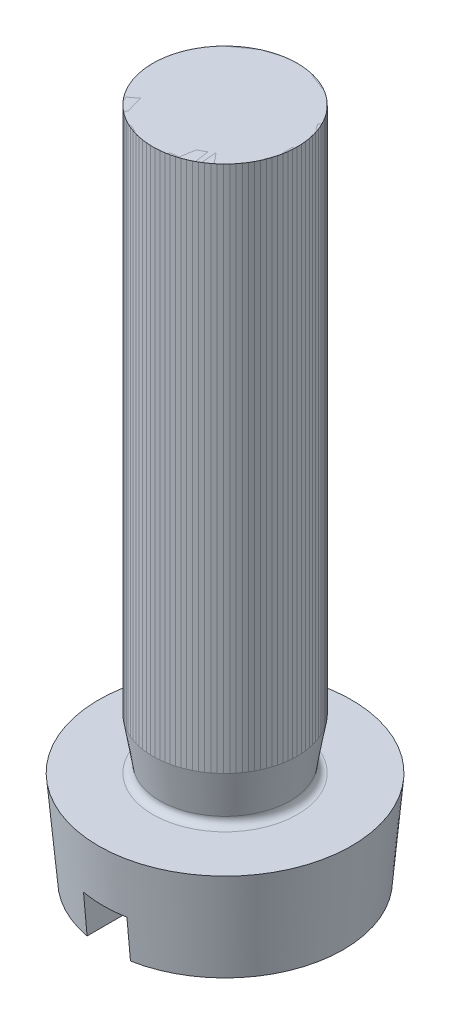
ISO-10303-21;
HEADER;
FILE_DESCRIPTION(('STEP AP214'),'2;1');
FILE_NAME('part.step','',(''),(''),'','','');
FILE_SCHEMA(('AUTOMOTIVE_DESIGN { 1 0 10303 214 1 1 1 1 }'));
ENDSEC;
DATA;
#1=APPLICATION_CONTEXT('core data for automotive mechanical design processes');
#2=APPLICATION_PROTOCOL_DEFINITION('international standard','automotive_design',2000,#1);
#3=PRODUCT_CONTEXT('',#1,'mechanical');
#4=PRODUCT('Part','Part','',(#3));
#5=PRODUCT_RELATED_PRODUCT_CATEGORY('part','',(#4));
#6=PRODUCT_DEFINITION_FORMATION('','',#4);
#7=PRODUCT_DEFINITION_CONTEXT('part definition',#1,'design');
#8=PRODUCT_DEFINITION('design','',#6,#7);
#9=PRODUCT_DEFINITION_SHAPE('','',#8);
#10=(LENGTH_UNIT() NAMED_UNIT(*) SI_UNIT(.MILLI.,.METRE.));
#11=(NAMED_UNIT(*) PLANE_ANGLE_UNIT() SI_UNIT($,.RADIAN.));
#12=(NAMED_UNIT(*) SI_UNIT($,.STERADIAN.) SOLID_ANGLE_UNIT());
#13=UNCERTAINTY_MEASURE_WITH_UNIT(LENGTH_MEASURE(1.E-05),#10,'distance_accuracy_value','');
#14=(GEOMETRIC_REPRESENTATION_CONTEXT(3) GLOBAL_UNCERTAINTY_ASSIGNED_CONTEXT((#13)) GLOBAL_UNIT_ASSIGNED_CONTEXT((#10,
#11,#12)) REPRESENTATION_CONTEXT('',''));
#15=CARTESIAN_POINT('',(0.,0.,0.));
#16=DIRECTION('',(0.,0.,1.));
#17=DIRECTION('',(1.,0.,0.));
#18=AXIS2_PLACEMENT_3D('',#15,#16,#17);
#19=CARTESIAN_POINT('',(0.,16.73,0.));
#20=DIRECTION('',(0.,-1.,0.));
#21=DIRECTION('',(0.,0.,-1.));
#22=AXIS2_PLACEMENT_3D('',#19,#20,#21);
#23=CYLINDRICAL_SURFACE('',#22,1.621125);
#24=CARTESIAN_POINT('',(0.,1.4,0.));
#25=DIRECTION('',(0.,-1.,0.));
#26=DIRECTION('',(0.,0.,-1.));
#27=AXIS2_PLACEMENT_3D('',#24,#25,#26);
#28=CIRCLE('',#27,1.621125);
#29=CARTESIAN_POINT('',(0.,1.4,-1.621125));
#30=VERTEX_POINT('',#29);
#31=EDGE_CURVE('P0_E16',#30,#30,#28,.F.);
#32=ORIENTED_EDGE('',*,*,#31,.F.);
#33=EDGE_LOOP('',(#32));
#34=FACE_BOUND('',#33,.T.);
#35=CARTESIAN_POINT('',(0.,16.,0.));
#36=DIRECTION('',(0.,-1.,0.));
#37=DIRECTION('',(0.,0.,-1.));
#38=AXIS2_PLACEMENT_3D('',#35,#36,#37);
#39=CIRCLE('',#38,1.621125);
#40=CARTESIAN_POINT('',(0.,16.,-1.621125));
#41=VERTEX_POINT('',#40);
#42=EDGE_CURVE('P0_E25',#41,#41,#39,.F.);
#43=ORIENTED_EDGE('',*,*,#42,.T.);
#44=EDGE_LOOP('',(#43));
#45=FACE_BOUND('',#44,.T.);
#46=ADVANCED_FACE('P0_F13',(#34,#45),#23,.F.);
#47=CARTESIAN_POINT('',(0.,1.4,0.));
#48=DIRECTION('',(0.,-1.,0.));
#49=DIRECTION('',(0.,0.,-1.));
#50=AXIS2_PLACEMENT_3D('',#47,#48,#49);
#51=PLANE('',#50);
#52=ORIENTED_EDGE('',*,*,#31,.T.);
#53=EDGE_LOOP('',(#52));
#54=FACE_BOUND('',#53,.T.);
#55=CARTESIAN_POINT('',(0.,1.4,0.));
#56=DIRECTION('',(0.,-1.,0.));
#57=DIRECTION('',(0.,0.,-1.));
#58=AXIS2_PLACEMENT_3D('',#55,#56,#57);
#59=CIRCLE('',#58,2.);
#60=CARTESIAN_POINT('',(0.,1.4,-2.));
#61=VERTEX_POINT('',#60);
#62=EDGE_CURVE('P0_E20',#61,#61,#59,.F.);
#63=ORIENTED_EDGE('',*,*,#62,.F.);
#64=EDGE_LOOP('',(#63));
#65=FACE_BOUND('',#64,.T.);
#66=ADVANCED_FACE('P0_F33',(#54,#65),#51,.T.);
#67=CARTESIAN_POINT('',(0.,16.,0.));
#68=DIRECTION('',(0.,-1.,0.));
#69=DIRECTION('',(0.,0.,-1.));
#70=AXIS2_PLACEMENT_3D('',#67,#68,#69);
#71=PLANE('',#70);
#72=ORIENTED_EDGE('',*,*,#42,.F.);
#73=EDGE_LOOP('',(#72));
#74=FACE_BOUND('',#73,.T.);
#75=CARTESIAN_POINT('',(0.,16.,0.));
#76=DIRECTION('',(0.,-1.,0.));
#77=DIRECTION('',(0.,0.,-1.));
#78=AXIS2_PLACEMENT_3D('',#75,#76,#77);
#79=CIRCLE('',#78,2.);
#80=CARTESIAN_POINT('',(0.,16.,-2.));
#81=VERTEX_POINT('',#80);
#82=EDGE_CURVE('P0_E9',#81,#81,#79,.T.);
#83=ORIENTED_EDGE('',*,*,#82,.F.);
#84=EDGE_LOOP('',(#83));
#85=FACE_BOUND('',#84,.T.);
#86=ADVANCED_FACE('P0_F41',(#74,#85),#71,.F.);
#87=CARTESIAN_POINT('',(0.,16.73,0.));
#88=DIRECTION('',(0.,-1.,0.));
#89=DIRECTION('',(0.,0.,-1.));
#90=AXIS2_PLACEMENT_3D('',#87,#88,#89);
#91=CYLINDRICAL_SURFACE('',#90,2.);
#92=ORIENTED_EDGE('',*,*,#82,.T.);
#93=EDGE_LOOP('',(#92));
#94=FACE_BOUND('',#93,.T.);
#95=ORIENTED_EDGE('',*,*,#62,.T.);
#96=EDGE_LOOP('',(#95));
#97=FACE_BOUND('',#96,.T.);
#98=ADVANCED_FACE('P0_F42',(#94,#97),#91,.T.);
#99=CLOSED_SHELL('',(#46,#66,#86,#98));
#100=MANIFOLD_SOLID_BREP('P0_B1',#99);
#101=CARTESIAN_POINT('',(0.6,-1.5,-4.2));
#102=DIRECTION('',(0.,1.,0.));
#103=DIRECTION('',(0.,0.,1.));
#104=AXIS2_PLACEMENT_3D('',#101,#102,#103);
#105=PLANE('',#104);
#106=CARTESIAN_POINT('',(0.,-1.50000000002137,0.));
#107=DIRECTION('',(0.,1.,0.));
#108=DIRECTION('',(0.,0.,1.));
#109=AXIS2_PLACEMENT_3D('',#106,#107,#108);
#110=CIRCLE('',#109,3.36876700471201);
#111=CARTESIAN_POINT('',(-0.6,-1.50000000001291,3.31490439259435));
#112=VERTEX_POINT('',#111);
#113=CARTESIAN_POINT('',(0.6,-1.50000000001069,3.31490439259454));
#114=VERTEX_POINT('',#113);
#115=EDGE_CURVE('P1_E74',#112,#114,#110,.T.);
#116=ORIENTED_EDGE('',*,*,#115,.F.);
#117=DIRECTION('',(0.,0.,1.));
#118=VECTOR('',#117,1.);
#119=CARTESIAN_POINT('',(-0.6,-1.5,-4.2));
#120=LINE('',#119,#118);
#121=CARTESIAN_POINT('',(-0.6,-1.50000000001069,-3.31490439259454));
#122=VERTEX_POINT('',#121);
#123=EDGE_CURVE('P1_E81',#112,#122,#120,.F.);
#124=ORIENTED_EDGE('',*,*,#123,.T.);
#125=CARTESIAN_POINT('',(0.,-1.50000000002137,0.));
#126=DIRECTION('',(0.,1.,0.));
#127=DIRECTION('',(0.,0.,1.));
#128=AXIS2_PLACEMENT_3D('',#125,#126,#127);
#129=CIRCLE('',#128,3.36876700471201);
#130=CARTESIAN_POINT('',(0.6,-1.50000000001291,-3.31490439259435));
#131=VERTEX_POINT('',#130);
#132=EDGE_CURVE('P1_E65',#131,#122,#129,.T.);
#133=ORIENTED_EDGE('',*,*,#132,.F.);
#134=DIRECTION('',(0.,0.,-1.));
#135=VECTOR('',#134,1.);
#136=CARTESIAN_POINT('',(0.6,-1.5,-4.2));
#137=LINE('',#136,#135);
#138=EDGE_CURVE('P1_E73',#131,#114,#137,.F.);
#139=ORIENTED_EDGE('',*,*,#138,.T.);
#140=EDGE_LOOP('',(#116,#124,#133,#139));
#141=FACE_BOUND('',#140,.T.);
#142=ADVANCED_FACE('P1_F15',(#141),#105,.F.);
#143=CARTESIAN_POINT('',(0.6,-2.6,-4.2));
#144=DIRECTION('',(1.,0.,0.));
#145=DIRECTION('',(0.,0.,-1.));
#146=AXIS2_PLACEMENT_3D('',#143,#144,#145);
#147=PLANE('',#146);
#148=ORIENTED_EDGE('',*,*,#138,.F.);
#149=CARTESIAN_POINT('',(0.6,-2.59999999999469,-3.21705597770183));
#150=CARTESIAN_POINT('',(0.6,-2.41666737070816,-3.23337196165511));
#151=CARTESIAN_POINT('',(0.6,-2.23333438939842,-3.24968398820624));
#152=CARTESIAN_POINT('',(0.6,-1.86666772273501,-3.282300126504));
#153=CARTESIAN_POINT('',(0.6,-1.68333403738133,-3.29860423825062));
#154=CARTESIAN_POINT('',(0.6,-1.50000000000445,-3.3149043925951));
#155=B_SPLINE_CURVE_WITH_KNOTS('',3,(#149,#150,#151,#152,#153,#154),.UNSPECIFIED.,.F.,.F.,(4,2,
4),(0.,0.5521716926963,1.10434338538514),.UNSPECIFIED.);
#156=CARTESIAN_POINT('',(0.6,-2.59999999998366,-3.21705597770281));
#157=VERTEX_POINT('',#156);
#158=EDGE_CURVE('P1_E61',#157,#131,#155,.T.);
#159=ORIENTED_EDGE('',*,*,#158,.F.);
#160=DIRECTION('',(0.,0.,-1.));
#161=VECTOR('',#160,1.);
#162=CARTESIAN_POINT('',(0.6,-2.6,0.));
#163=LINE('',#162,#161);
#164=CARTESIAN_POINT('',(0.6,-2.59999999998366,3.21705597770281));
#165=VERTEX_POINT('',#164);
#166=EDGE_CURVE('P1_E111',#165,#157,#163,.T.);
#167=ORIENTED_EDGE('',*,*,#166,.F.);
#168=CARTESIAN_POINT('',(0.6,-1.50000000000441,3.3149043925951));
#169=CARTESIAN_POINT('',(0.6,-1.6833340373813,3.29860423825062));
#170=CARTESIAN_POINT('',(0.6,-1.86666772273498,3.282300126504));
#171=CARTESIAN_POINT('',(0.6,-2.23333438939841,3.24968398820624));
#172=CARTESIAN_POINT('',(0.6,-2.41666737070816,3.23337196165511));
#173=CARTESIAN_POINT('',(0.6,-2.59999999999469,3.21705597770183));
#174=B_SPLINE_CURVE_WITH_KNOTS('',3,(#168,#169,#170,#171,#172,#173),.UNSPECIFIED.,.F.,.F.,(4,2,
4),(0.,0.552171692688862,1.10434338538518),.UNSPECIFIED.);
#175=EDGE_CURVE('P1_E85',#114,#165,#174,.T.);
#176=ORIENTED_EDGE('',*,*,#175,.F.);
#177=EDGE_LOOP('',(#148,#159,#167,#176));
#178=FACE_BOUND('',#177,.T.);
#179=ADVANCED_FACE('P1_F84',(#178),#147,.F.);
#180=CARTESIAN_POINT('',(-0.6,-1.5,-4.2));
#181=DIRECTION('',(-1.,0.,0.));
#182=DIRECTION('',(0.,0.,1.));
#183=AXIS2_PLACEMENT_3D('',#180,#181,#182);
#184=PLANE('',#183);
#185=ORIENTED_EDGE('',*,*,#123,.F.);
#186=CARTESIAN_POINT('',(-0.6,-2.59999999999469,3.21705597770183));
#187=CARTESIAN_POINT('',(-0.6,-2.41666737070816,3.23337196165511));
#188=CARTESIAN_POINT('',(-0.6,-2.23333438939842,3.24968398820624));
#189=CARTESIAN_POINT('',(-0.6,-1.86666772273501,3.282300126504));
#190=CARTESIAN_POINT('',(-0.6,-1.68333403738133,3.29860423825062));
#191=CARTESIAN_POINT('',(-0.6,-1.50000000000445,3.3149043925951));
#192=B_SPLINE_CURVE_WITH_KNOTS('',3,(#186,#187,#188,#189,#190,#191),.UNSPECIFIED.,.F.,.F.,(4,2,
4),(0.,0.5521716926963,1.10434338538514),.UNSPECIFIED.);
#193=CARTESIAN_POINT('',(-0.6,-2.59999999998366,3.21705597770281));
#194=VERTEX_POINT('',#193);
#195=EDGE_CURVE('P1_E87',#194,#112,#192,.T.);
#196=ORIENTED_EDGE('',*,*,#195,.F.);
#197=DIRECTION('',(0.,0.,-1.));
#198=VECTOR('',#197,1.);
#199=CARTESIAN_POINT('',(-0.6,-2.6,0.));
#200=LINE('',#199,#198);
#201=CARTESIAN_POINT('',(-0.6,-2.59999999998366,-3.21705597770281));
#202=VERTEX_POINT('',#201);
#203=EDGE_CURVE('P1_E103',#202,#194,#200,.F.);
#204=ORIENTED_EDGE('',*,*,#203,.F.);
#205=CARTESIAN_POINT('',(-0.6,-1.50000000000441,-3.3149043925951));
#206=CARTESIAN_POINT('',(-0.6,-1.6833340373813,-3.29860423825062));
#207=CARTESIAN_POINT('',(-0.6,-1.86666772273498,-3.282300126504));
#208=CARTESIAN_POINT('',(-0.6,-2.23333438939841,-3.24968398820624));
#209=CARTESIAN_POINT('',(-0.6,-2.41666737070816,-3.23337196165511));
#210=CARTESIAN_POINT('',(-0.6,-2.59999999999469,-3.21705597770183));
#211=B_SPLINE_CURVE_WITH_KNOTS('',3,(#205,#206,#207,#208,#209,#210),.UNSPECIFIED.,.F.,.F.,(4,2,
4),(0.,0.552171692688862,1.10434338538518),.UNSPECIFIED.);
#212=EDGE_CURVE('P1_E104',#122,#202,#211,.T.);
#213=ORIENTED_EDGE('',*,*,#212,.F.);
#214=EDGE_LOOP('',(#185,#196,#204,#213));
#215=FACE_BOUND('',#214,.T.);
#216=ADVANCED_FACE('P1_F115',(#215),#184,.F.);
#217=CARTESIAN_POINT('',(0.,-2.6,0.));
#218=DIRECTION('',(0.,-1.,0.));
#219=DIRECTION('',(0.,0.,-1.));
#220=AXIS2_PLACEMENT_3D('',#217,#218,#219);
#221=PLANE('',#220);
#222=CARTESIAN_POINT('',(0.,-2.59999999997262,0.));
#223=DIRECTION('',(0.,1.,0.));
#224=DIRECTION('',(0.,0.,1.));
#225=AXIS2_PLACEMENT_3D('',#222,#223,#224);
#226=CIRCLE('',#225,3.27252947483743);
#227=EDGE_CURVE('P1_E68',#165,#157,#226,.T.);
#228=ORIENTED_EDGE('',*,*,#227,.F.);
#229=ORIENTED_EDGE('',*,*,#166,.T.);
#230=EDGE_LOOP('',(#228,#229));
#231=FACE_BOUND('',#230,.T.);
#232=ADVANCED_FACE('P1_F144',(#231),#221,.T.);
#233=CARTESIAN_POINT('',(0.,-2.6,0.));
#234=DIRECTION('',(0.,-1.,0.));
#235=DIRECTION('',(0.,0.,-1.));
#236=AXIS2_PLACEMENT_3D('',#233,#234,#235);
#237=PLANE('',#236);
#238=CARTESIAN_POINT('',(0.,-2.59999999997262,0.));
#239=DIRECTION('',(0.,1.,0.));
#240=DIRECTION('',(0.,0.,1.));
#241=AXIS2_PLACEMENT_3D('',#238,#239,#240);
#242=CIRCLE('',#241,3.27252947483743);
#243=EDGE_CURVE('P1_E99',#202,#194,#242,.T.);
#244=ORIENTED_EDGE('',*,*,#243,.F.);
#245=ORIENTED_EDGE('',*,*,#203,.T.);
#246=EDGE_LOOP('',(#244,#245));
#247=FACE_BOUND('',#246,.T.);
#248=ADVANCED_FACE('P1_F123',(#247),#237,.T.);
#249=CARTESIAN_POINT('',(0.,-1.70530256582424E-10,0.));
#250=DIRECTION('',(0.,1.,0.));
#251=DIRECTION('',(0.,0.,1.));
#252=AXIS2_PLACEMENT_3D('',#249,#250,#251);
#253=CONICAL_SURFACE('',#252,3.49999999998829,0.087266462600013);
#254=CARTESIAN_POINT('',(0.,0.,0.));
#255=DIRECTION('',(0.,1.,0.));
#256=DIRECTION('',(0.,0.,1.));
#257=AXIS2_PLACEMENT_3D('',#254,#255,#256);
#258=CIRCLE('',#257,3.50000000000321);
#259=CARTESIAN_POINT('',(0.,0.,3.50000000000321));
#260=VERTEX_POINT('',#259);
#261=EDGE_CURVE('P1_E95',#260,#260,#258,.F.);
#262=ORIENTED_EDGE('',*,*,#261,.T.);
#263=EDGE_LOOP('',(#262));
#264=FACE_BOUND('',#263,.T.);
#265=ORIENTED_EDGE('',*,*,#115,.T.);
#266=ORIENTED_EDGE('',*,*,#175,.T.);
#267=ORIENTED_EDGE('',*,*,#227,.T.);
#268=ORIENTED_EDGE('',*,*,#158,.T.);
#269=ORIENTED_EDGE('',*,*,#132,.T.);
#270=ORIENTED_EDGE('',*,*,#212,.T.);
#271=ORIENTED_EDGE('',*,*,#243,.T.);
#272=ORIENTED_EDGE('',*,*,#195,.T.);
#273=EDGE_LOOP('',(#265,#266,#267,#268,#269,#270,#271,#272));
#274=FACE_BOUND('',#273,.T.);
#275=ADVANCED_FACE('P1_F63',(#264,#274),#253,.T.);
#276=CARTESIAN_POINT('',(0.,0.,0.));
#277=DIRECTION('',(0.,-1.,0.));
#278=DIRECTION('',(0.,0.,-1.));
#279=AXIS2_PLACEMENT_3D('',#276,#277,#278);
#280=PLANE('',#279);
#281=CARTESIAN_POINT('',(0.,0.,0.));
#282=DIRECTION('',(0.,1.,0.));
#283=DIRECTION('',(0.,0.,-1.));
#284=AXIS2_PLACEMENT_3D('',#281,#282,#283);
#285=CIRCLE('',#284,2.);
#286=CARTESIAN_POINT('',(0.,0.,2.));
#287=VERTEX_POINT('',#286);
#288=CARTESIAN_POINT('',(0.,0.,-2.));
#289=VERTEX_POINT('',#288);
#290=EDGE_CURVE('P1_E34',#287,#289,#285,.F.);
#291=ORIENTED_EDGE('',*,*,#290,.T.);
#292=CARTESIAN_POINT('',(0.,0.,0.));
#293=DIRECTION('',(0.,1.,0.));
#294=DIRECTION('',(0.,0.,1.));
#295=AXIS2_PLACEMENT_3D('',#292,#293,#294);
#296=CIRCLE('',#295,2.);
#297=EDGE_CURVE('P1_E98',#289,#287,#296,.F.);
#298=ORIENTED_EDGE('',*,*,#297,.T.);
#299=EDGE_LOOP('',(#291,#298));
#300=FACE_BOUND('',#299,.T.);
#301=ORIENTED_EDGE('',*,*,#261,.F.);
#302=EDGE_LOOP('',(#301));
#303=FACE_BOUND('',#302,.T.);
#304=ADVANCED_FACE('P1_F122',(#300,#303),#280,.F.);
#305=CARTESIAN_POINT('',(0.,0.2,0.));
#306=DIRECTION('',(0.,1.,0.));
#307=DIRECTION('',(0.,0.,-1.));
#308=AXIS2_PLACEMENT_3D('',#305,#306,#307);
#309=TOROIDAL_SURFACE('',#308,2.,0.2);
#310=CARTESIAN_POINT('',(0.,0.233333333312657,0.));
#311=DIRECTION('',(0.,1.,0.));
#312=DIRECTION('',(0.,0.,-1.));
#313=AXIS2_PLACEMENT_3D('',#310,#311,#312);
#314=CIRCLE('',#313,1.80279734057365);
#315=CARTESIAN_POINT('',(0.,0.233333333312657,-1.80279734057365));
#316=VERTEX_POINT('',#315);
#317=EDGE_CURVE('P1_E94',#316,#316,#314,.T.);
#318=ORIENTED_EDGE('',*,*,#317,.F.);
#319=EDGE_LOOP('',(#318));
#320=FACE_BOUND('',#319,.T.);
#321=ORIENTED_EDGE('',*,*,#297,.F.);
#322=ORIENTED_EDGE('',*,*,#290,.F.);
#323=EDGE_LOOP('',(#321,#322));
#324=FACE_BOUND('',#323,.T.);
#325=ADVANCED_FACE('P1_F160',(#320,#324),#309,.F.);
#326=CARTESIAN_POINT('',(0.,16.,0.));
#327=DIRECTION('',(0.,1.,0.));
#328=DIRECTION('',(0.,0.,1.));
#329=AXIS2_PLACEMENT_3D('',#326,#327,#328);
#330=PLANE('',#329);
#331=CARTESIAN_POINT('',(0.,16.,0.));
#332=DIRECTION('',(0.,1.,0.));
#333=DIRECTION('',(0.,0.,1.));
#334=AXIS2_PLACEMENT_3D('',#331,#332,#333);
#335=CIRCLE('',#334,2.);
#336=CARTESIAN_POINT('',(0.,16.,2.));
#337=VERTEX_POINT('',#336);
#338=EDGE_CURVE('P1_E26',#337,#337,#335,.F.);
#339=ORIENTED_EDGE('',*,*,#338,.F.);
#340=EDGE_LOOP('',(#339));
#341=FACE_BOUND('',#340,.T.);
#342=ADVANCED_FACE('P1_F154',(#341),#330,.T.);
#343=CARTESIAN_POINT('',(0.,1.39999999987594,0.));
#344=DIRECTION('',(0.,1.,0.));
#345=DIRECTION('',(0.,0.,1.));
#346=AXIS2_PLACEMENT_3D('',#343,#344,#345);
#347=CONICAL_SURFACE('',#346,1.99999999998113,0.16744807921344);
#348=ORIENTED_EDGE('',*,*,#317,.T.);
#349=EDGE_LOOP('',(#348));
#350=FACE_BOUND('',#349,.T.);
#351=CARTESIAN_POINT('',(0.,1.4,0.));
#352=DIRECTION('',(0.,1.,0.));
#353=DIRECTION('',(0.,0.,1.));
#354=AXIS2_PLACEMENT_3D('',#351,#352,#353);
#355=CIRCLE('',#354,2.);
#356=CARTESIAN_POINT('',(0.,1.4,2.));
#357=VERTEX_POINT('',#356);
#358=EDGE_CURVE('P1_E10',#357,#357,#355,.T.);
#359=ORIENTED_EDGE('',*,*,#358,.F.);
#360=EDGE_LOOP('',(#359));
#361=FACE_BOUND('',#360,.T.);
#362=ADVANCED_FACE('P1_F148',(#350,#361),#347,.T.);
#363=CARTESIAN_POINT('',(0.,-0.8,0.));
#364=DIRECTION('',(0.,1.,0.));
#365=DIRECTION('',(0.,0.,1.));
#366=AXIS2_PLACEMENT_3D('',#363,#364,#365);
#367=CYLINDRICAL_SURFACE('',#366,2.);
#368=ORIENTED_EDGE('',*,*,#338,.T.);
#369=EDGE_LOOP('',(#368));
#370=FACE_BOUND('',#369,.T.);
#371=ORIENTED_EDGE('',*,*,#358,.T.);
#372=EDGE_LOOP('',(#371));
#373=FACE_BOUND('',#372,.T.);
#374=ADVANCED_FACE('P1_F146',(#370,#373),#367,.T.);
#375=CLOSED_SHELL('',(#142,#179,#216,#232,#248,#275,#304,#325,#342,#362,#374));
#376=MANIFOLD_SOLID_BREP('P1_B1',#375);
#377=ADVANCED_BREP_SHAPE_REPRESENTATION('',(#18,#100,#376),#14);
#378=SHAPE_DEFINITION_REPRESENTATION(#9,#377);
ENDSEC;
END-ISO-10303-21;
